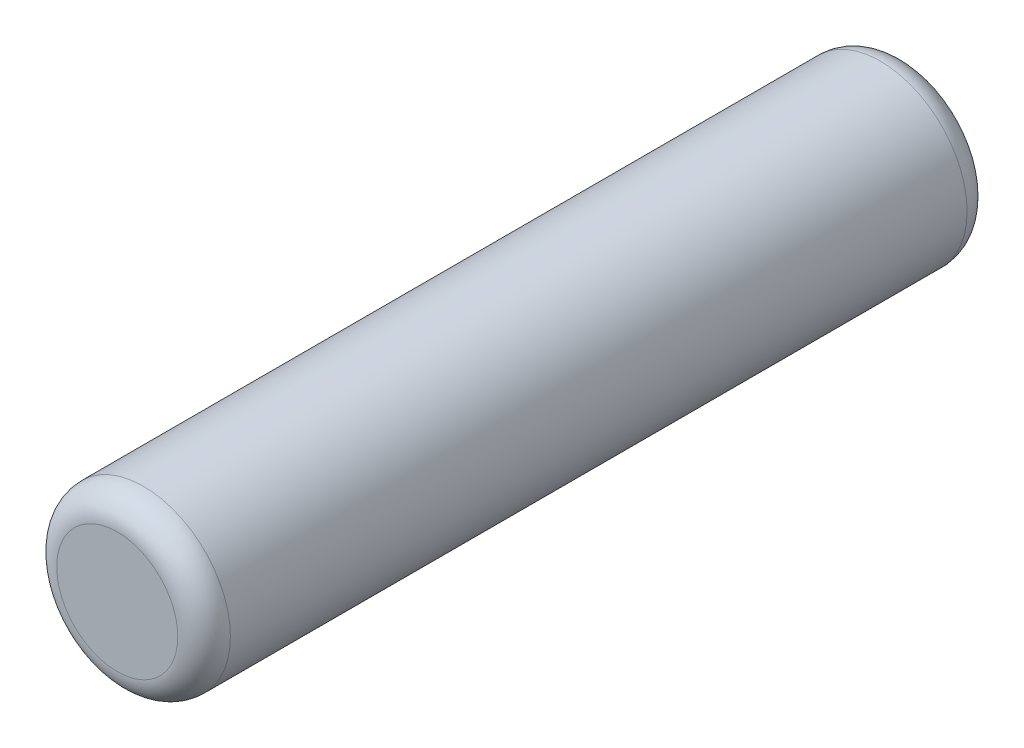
ISO-10303-21;
HEADER;
FILE_DESCRIPTION(('STEP AP214'),'2;1');
FILE_NAME('part.step','',(''),(''),'','','');
FILE_SCHEMA(('AUTOMOTIVE_DESIGN { 1 0 10303 214 1 1 1 1 }'));
ENDSEC;
DATA;
#1=APPLICATION_CONTEXT('core data for automotive mechanical design processes');
#2=APPLICATION_PROTOCOL_DEFINITION('international standard','automotive_design',2000,#1);
#3=PRODUCT_CONTEXT('',#1,'mechanical');
#4=PRODUCT('Part','Part','',(#3));
#5=PRODUCT_RELATED_PRODUCT_CATEGORY('part','',(#4));
#6=PRODUCT_DEFINITION_FORMATION('','',#4);
#7=PRODUCT_DEFINITION_CONTEXT('part definition',#1,'design');
#8=PRODUCT_DEFINITION('design','',#6,#7);
#9=PRODUCT_DEFINITION_SHAPE('','',#8);
#10=(LENGTH_UNIT() NAMED_UNIT(*) SI_UNIT(.MILLI.,.METRE.));
#11=(NAMED_UNIT(*) PLANE_ANGLE_UNIT() SI_UNIT($,.RADIAN.));
#12=(NAMED_UNIT(*) SI_UNIT($,.STERADIAN.) SOLID_ANGLE_UNIT());
#13=UNCERTAINTY_MEASURE_WITH_UNIT(LENGTH_MEASURE(1.E-05),#10,'distance_accuracy_value','');
#14=(GEOMETRIC_REPRESENTATION_CONTEXT(3) GLOBAL_UNCERTAINTY_ASSIGNED_CONTEXT((#13)) GLOBAL_UNIT_ASSIGNED_CONTEXT((#10,
#11,#12)) REPRESENTATION_CONTEXT('',''));
#15=CARTESIAN_POINT('',(0.,0.,0.));
#16=DIRECTION('',(0.,0.,1.));
#17=DIRECTION('',(1.,0.,0.));
#18=AXIS2_PLACEMENT_3D('',#15,#16,#17);
#19=CARTESIAN_POINT('',(0.,0.,30.));
#20=DIRECTION('',(0.,0.,-1.));
#21=DIRECTION('',(-1.,0.,0.));
#22=AXIS2_PLACEMENT_3D('',#19,#20,#21);
#23=CYLINDRICAL_SURFACE('',#22,3.3);
#24=CARTESIAN_POINT('',(0.,0.,1.));
#25=DIRECTION('',(0.,0.,1.));
#26=DIRECTION('',(1.,0.,0.));
#27=AXIS2_PLACEMENT_3D('',#24,#25,#26);
#28=CIRCLE('',#27,3.3);
#29=CARTESIAN_POINT('',(3.3,0.,1.));
#30=VERTEX_POINT('',#29);
#31=EDGE_CURVE('E40',#30,#30,#28,.T.);
#32=ORIENTED_EDGE('',*,*,#31,.T.);
#33=EDGE_LOOP('',(#32));
#34=FACE_BOUND('',#33,.T.);
#35=CARTESIAN_POINT('',(0.,0.,29.));
#36=DIRECTION('',(0.,0.,1.));
#37=DIRECTION('',(1.,0.,0.));
#38=AXIS2_PLACEMENT_3D('',#35,#36,#37);
#39=CIRCLE('',#38,3.3);
#40=CARTESIAN_POINT('',(3.3,0.,29.));
#41=VERTEX_POINT('',#40);
#42=EDGE_CURVE('E44',#41,#41,#39,.F.);
#43=ORIENTED_EDGE('',*,*,#42,.T.);
#44=EDGE_LOOP('',(#43));
#45=FACE_BOUND('',#44,.T.);
#46=ADVANCED_FACE('F29',(#34,#45),#23,.T.);
#47=CARTESIAN_POINT('',(0.,0.,30.));
#48=DIRECTION('',(0.,0.,1.));
#49=DIRECTION('',(1.,0.,0.));
#50=AXIS2_PLACEMENT_3D('',#47,#48,#49);
#51=PLANE('',#50);
#52=CARTESIAN_POINT('',(0.,0.,30.));
#53=DIRECTION('',(0.,0.,1.));
#54=DIRECTION('',(1.,0.,0.));
#55=AXIS2_PLACEMENT_3D('',#52,#53,#54);
#56=CIRCLE('',#55,2.3);
#57=CARTESIAN_POINT('',(2.3,0.,30.));
#58=VERTEX_POINT('',#57);
#59=EDGE_CURVE('E10',#58,#58,#56,.T.);
#60=ORIENTED_EDGE('',*,*,#59,.T.);
#61=EDGE_LOOP('',(#60));
#62=FACE_BOUND('',#61,.T.);
#63=ADVANCED_FACE('F60',(#62),#51,.T.);
#64=CARTESIAN_POINT('',(0.,0.,0.));
#65=DIRECTION('',(0.,0.,1.));
#66=DIRECTION('',(1.,0.,0.));
#67=AXIS2_PLACEMENT_3D('',#64,#65,#66);
#68=PLANE('',#67);
#69=CARTESIAN_POINT('',(0.,0.,0.));
#70=DIRECTION('',(0.,0.,1.));
#71=DIRECTION('',(1.,0.,0.));
#72=AXIS2_PLACEMENT_3D('',#69,#70,#71);
#73=CIRCLE('',#72,2.3);
#74=CARTESIAN_POINT('',(2.3,0.,0.));
#75=VERTEX_POINT('',#74);
#76=EDGE_CURVE('E36',#75,#75,#73,.F.);
#77=ORIENTED_EDGE('',*,*,#76,.T.);
#78=EDGE_LOOP('',(#77));
#79=FACE_BOUND('',#78,.T.);
#80=ADVANCED_FACE('F57',(#79),#68,.F.);
#81=CARTESIAN_POINT('',(0.,0.,1.));
#82=DIRECTION('',(0.,0.,1.));
#83=DIRECTION('',(1.,0.,0.));
#84=AXIS2_PLACEMENT_3D('',#81,#82,#83);
#85=TOROIDAL_SURFACE('',#84,2.3,1.);
#86=ORIENTED_EDGE('',*,*,#76,.F.);
#87=EDGE_LOOP('',(#86));
#88=FACE_BOUND('',#87,.T.);
#89=ORIENTED_EDGE('',*,*,#31,.F.);
#90=EDGE_LOOP('',(#89));
#91=FACE_BOUND('',#90,.T.);
#92=ADVANCED_FACE('F53',(#88,#91),#85,.T.);
#93=CARTESIAN_POINT('',(0.,0.,29.));
#94=DIRECTION('',(0.,0.,1.));
#95=DIRECTION('',(1.,0.,0.));
#96=AXIS2_PLACEMENT_3D('',#93,#94,#95);
#97=TOROIDAL_SURFACE('',#96,2.3,1.);
#98=ORIENTED_EDGE('',*,*,#42,.F.);
#99=EDGE_LOOP('',(#98));
#100=FACE_BOUND('',#99,.T.);
#101=ORIENTED_EDGE('',*,*,#59,.F.);
#102=EDGE_LOOP('',(#101));
#103=FACE_BOUND('',#102,.T.);
#104=ADVANCED_FACE('F31',(#100,#103),#97,.T.);
#105=CLOSED_SHELL('',(#46,#63,#80,#92,#104));
#106=MANIFOLD_SOLID_BREP('B2',#105);
#107=ADVANCED_BREP_SHAPE_REPRESENTATION('',(#18,#106),#14);
#108=SHAPE_DEFINITION_REPRESENTATION(#9,#107);
ENDSEC;
END-ISO-10303-21;
